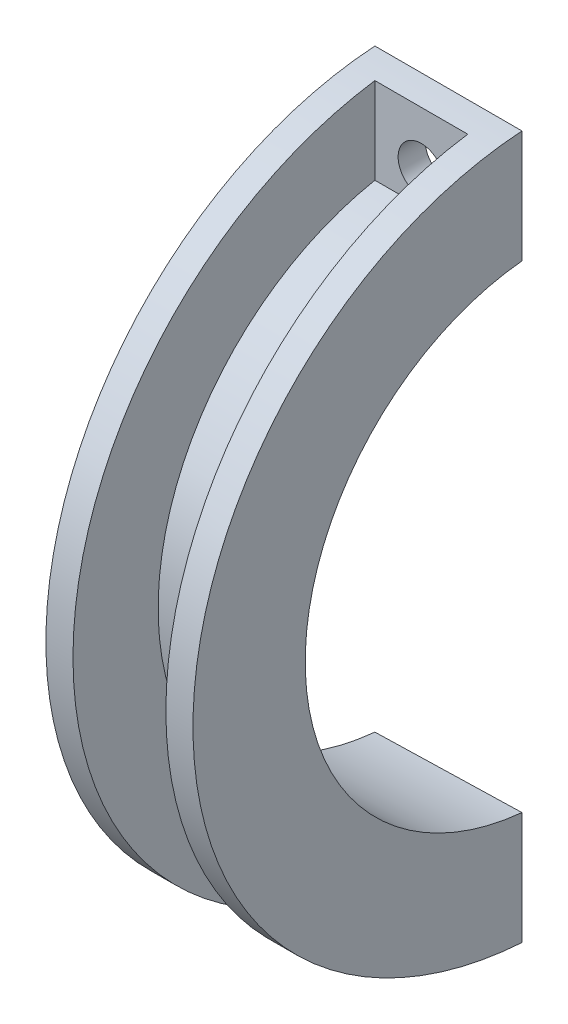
ISO-10303-21;
HEADER;
FILE_DESCRIPTION(('STEP AP214'),'2;1');
FILE_NAME('part.step','',(''),(''),'','','');
FILE_SCHEMA(('AUTOMOTIVE_DESIGN { 1 0 10303 214 1 1 1 1 }'));
ENDSEC;
DATA;
#1=APPLICATION_CONTEXT('core data for automotive mechanical design processes');
#2=APPLICATION_PROTOCOL_DEFINITION('international standard','automotive_design',2000,#1);
#3=PRODUCT_CONTEXT('',#1,'mechanical');
#4=PRODUCT('Part','Part','',(#3));
#5=PRODUCT_RELATED_PRODUCT_CATEGORY('part','',(#4));
#6=PRODUCT_DEFINITION_FORMATION('','',#4);
#7=PRODUCT_DEFINITION_CONTEXT('part definition',#1,'design');
#8=PRODUCT_DEFINITION('design','',#6,#7);
#9=PRODUCT_DEFINITION_SHAPE('','',#8);
#10=(LENGTH_UNIT() NAMED_UNIT(*) SI_UNIT(.MILLI.,.METRE.));
#11=(NAMED_UNIT(*) PLANE_ANGLE_UNIT() SI_UNIT($,.RADIAN.));
#12=(NAMED_UNIT(*) SI_UNIT($,.STERADIAN.) SOLID_ANGLE_UNIT());
#13=UNCERTAINTY_MEASURE_WITH_UNIT(LENGTH_MEASURE(1.E-05),#10,'distance_accuracy_value','');
#14=(GEOMETRIC_REPRESENTATION_CONTEXT(3) GLOBAL_UNCERTAINTY_ASSIGNED_CONTEXT((#13)) GLOBAL_UNIT_ASSIGNED_CONTEXT((#10,
#11,#12)) REPRESENTATION_CONTEXT('',''));
#15=CARTESIAN_POINT('',(0.,0.,0.));
#16=DIRECTION('',(0.,0.,1.));
#17=DIRECTION('',(1.,0.,0.));
#18=AXIS2_PLACEMENT_3D('',#15,#16,#17);
#19=CARTESIAN_POINT('',(589.521731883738,0.,2.99999999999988));
#20=DIRECTION('',(-1.,0.,0.));
#21=DIRECTION('',(0.,-1.,0.));
#22=AXIS2_PLACEMENT_3D('',#19,#20,#21);
#23=CYLINDRICAL_SURFACE('',#22,45.5);
#24=CARTESIAN_POINT('',(578.076766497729,0.,2.99999999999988));
#25=DIRECTION('',(-1.,0.,0.));
#26=DIRECTION('',(0.,-1.,0.));
#27=AXIS2_PLACEMENT_3D('',#24,#25,#26);
#28=CIRCLE('',#27,45.5);
#29=CARTESIAN_POINT('',(578.076766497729,-45.4009911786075,5.9999999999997));
#30=VERTEX_POINT('',#29);
#31=CARTESIAN_POINT('',(578.076766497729,45.4009911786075,5.99999999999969));
#32=VERTEX_POINT('',#31);
#33=EDGE_CURVE('E113',#30,#32,#28,.T.);
#34=ORIENTED_EDGE('',*,*,#33,.T.);
#35=DIRECTION('',(-1.,0.,0.));
#36=VECTOR('',#35,1.);
#37=CARTESIAN_POINT('',(589.521731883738,45.4009911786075,5.99999999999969));
#38=LINE('',#37,#36);
#39=CARTESIAN_POINT('',(559.076766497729,45.4009911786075,5.99999999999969));
#40=VERTEX_POINT('',#39);
#41=EDGE_CURVE('E46',#32,#40,#38,.T.);
#42=ORIENTED_EDGE('',*,*,#41,.T.);
#43=CARTESIAN_POINT('',(559.076766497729,0.,2.99999999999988));
#44=DIRECTION('',(-1.,0.,0.));
#45=DIRECTION('',(0.,-1.,0.));
#46=AXIS2_PLACEMENT_3D('',#43,#44,#45);
#47=CIRCLE('',#46,45.5);
#48=CARTESIAN_POINT('',(559.076766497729,-45.4009911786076,5.9999999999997));
#49=VERTEX_POINT('',#48);
#50=EDGE_CURVE('E116',#49,#40,#47,.T.);
#51=ORIENTED_EDGE('',*,*,#50,.F.);
#52=DIRECTION('',(-1.,0.,0.));
#53=VECTOR('',#52,1.);
#54=CARTESIAN_POINT('',(589.521731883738,-45.4009911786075,5.9999999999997));
#55=LINE('',#54,#53);
#56=EDGE_CURVE('E203',#49,#30,#55,.F.);
#57=ORIENTED_EDGE('',*,*,#56,.T.);
#58=EDGE_LOOP('',(#34,#42,#51,#57));
#59=FACE_BOUND('',#58,.T.);
#60=CARTESIAN_POINT('',(574.576766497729,0.,2.99999999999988));
#61=DIRECTION('',(-1.,0.,0.));
#62=DIRECTION('',(0.,-1.,0.));
#63=AXIS2_PLACEMENT_3D('',#60,#61,#62);
#64=CIRCLE('',#63,45.5);
#65=CARTESIAN_POINT('',(574.576766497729,-45.0333209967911,9.50000000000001));
#66=VERTEX_POINT('',#65);
#67=CARTESIAN_POINT('',(574.576766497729,45.0333209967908,9.50000000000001));
#68=VERTEX_POINT('',#67);
#69=EDGE_CURVE('E11',#66,#68,#64,.T.);
#70=ORIENTED_EDGE('',*,*,#69,.F.);
#71=DIRECTION('',(-1.,0.,0.));
#72=VECTOR('',#71,1.);
#73=CARTESIAN_POINT('',(574.576766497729,-45.0333209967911,9.50000000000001));
#74=LINE('',#73,#72);
#75=CARTESIAN_POINT('',(562.576766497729,-45.0333209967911,9.50000000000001));
#76=VERTEX_POINT('',#75);
#77=EDGE_CURVE('E114',#66,#76,#74,.T.);
#78=ORIENTED_EDGE('',*,*,#77,.T.);
#79=CARTESIAN_POINT('',(562.576766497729,0.,2.99999999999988));
#80=DIRECTION('',(-1.,0.,0.));
#81=DIRECTION('',(0.,-1.,0.));
#82=AXIS2_PLACEMENT_3D('',#79,#80,#81);
#83=CIRCLE('',#82,45.5);
#84=CARTESIAN_POINT('',(562.576766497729,45.0333209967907,9.50000000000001));
#85=VERTEX_POINT('',#84);
#86=EDGE_CURVE('E38',#76,#85,#83,.T.);
#87=ORIENTED_EDGE('',*,*,#86,.T.);
#88=DIRECTION('',(-1.,0.,0.));
#89=VECTOR('',#88,1.);
#90=CARTESIAN_POINT('',(574.576766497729,45.0333209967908,9.50000000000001));
#91=LINE('',#90,#89);
#92=EDGE_CURVE('E122',#68,#85,#91,.T.);
#93=ORIENTED_EDGE('',*,*,#92,.F.);
#94=EDGE_LOOP('',(#70,#78,#87,#93));
#95=FACE_BOUND('',#94,.T.);
#96=ADVANCED_FACE('F29',(#59,#95),#23,.T.);
#97=CARTESIAN_POINT('',(559.076766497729,0.,2.99999999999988));
#98=DIRECTION('',(-1.,0.,0.));
#99=DIRECTION('',(0.,-1.,0.));
#100=AXIS2_PLACEMENT_3D('',#97,#98,#99);
#101=CONICAL_SURFACE('',#100,31.4975325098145,0.0261799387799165);
#102=CARTESIAN_POINT('',(562.757658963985,-1.25660767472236,34.3759914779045));
#103=CARTESIAN_POINT('',(562.828250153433,-1.30261747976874,34.3722989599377));
#104=CARTESIAN_POINT('',(562.902778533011,-1.34269937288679,34.3686395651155));
#105=CARTESIAN_POINT('',(563.057581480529,-1.40981552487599,34.3616373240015));
#106=CARTESIAN_POINT('',(563.137862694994,-1.43683440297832,34.3582948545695));
#107=CARTESIAN_POINT('',(563.301817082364,-1.4769970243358,34.352130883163));
#108=CARTESIAN_POINT('',(563.385488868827,-1.49014638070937,34.3493091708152));
#109=CARTESIAN_POINT('',(563.553849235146,-1.50219727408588,34.3443203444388));
#110=CARTESIAN_POINT('',(563.638537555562,-1.50110237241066,34.3421530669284));
#111=CARTESIAN_POINT('',(563.806454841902,-1.4847059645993,34.3385320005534));
#112=CARTESIAN_POINT('',(563.889685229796,-1.46941918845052,34.3370774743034));
#113=CARTESIAN_POINT('',(564.052410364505,-1.42508751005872,34.3348591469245));
#114=CARTESIAN_POINT('',(564.131904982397,-1.39604213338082,34.3340953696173));
#115=CARTESIAN_POINT('',(564.284826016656,-1.32504787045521,34.3331696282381));
#116=CARTESIAN_POINT('',(564.358257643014,-1.28311021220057,34.333007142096));
#117=CARTESIAN_POINT('',(564.497045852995,-1.18751261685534,34.3331387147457));
#118=CARTESIAN_POINT('',(564.56240243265,-1.13385267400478,34.3334327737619));
#119=CARTESIAN_POINT('',(564.683213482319,-1.01630756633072,34.3343001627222));
#120=CARTESIAN_POINT('',(564.738663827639,-0.952418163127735,34.3348736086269));
#121=CARTESIAN_POINT('',(564.838057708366,-0.816241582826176,34.336112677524));
#122=CARTESIAN_POINT('',(564.882001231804,-0.74395439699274,34.3367783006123));
#123=CARTESIAN_POINT('',(564.95715615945,-0.592990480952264,34.3380300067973));
#124=CARTESIAN_POINT('',(564.988360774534,-0.5143103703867,34.3386160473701));
#125=CARTESIAN_POINT('',(565.03711809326,-0.352826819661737,34.3395731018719));
#126=CARTESIAN_POINT('',(565.054670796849,-0.270023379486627,34.3399441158));
#127=CARTESIAN_POINT('',(565.075624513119,-0.102650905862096,34.3403904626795));
#128=CARTESIAN_POINT('',(565.079026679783,-0.0180820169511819,34.3404658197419));
#129=CARTESIAN_POINT('',(565.071585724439,0.150426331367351,34.3403049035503));
#130=CARTESIAN_POINT('',(565.060742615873,0.234365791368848,34.3400686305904));
#131=CARTESIAN_POINT('',(565.025122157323,0.399219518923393,34.3393351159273));
#132=CARTESIAN_POINT('',(565.000346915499,0.480134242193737,34.3388379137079));
#133=CARTESIAN_POINT('',(564.937567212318,0.636656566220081,34.3376933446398));
#134=CARTESIAN_POINT('',(564.899562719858,0.71226415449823,34.3370459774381));
#135=CARTESIAN_POINT('',(564.811393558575,0.856042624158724,34.3357578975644));
#136=CARTESIAN_POINT('',(564.761226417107,0.924211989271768,34.3351171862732));
#137=CARTESIAN_POINT('',(564.650158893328,1.05116213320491,34.3340257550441));
#138=CARTESIAN_POINT('',(564.589258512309,1.10994291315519,34.3335750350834));
#139=CARTESIAN_POINT('',(564.458454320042,1.21644543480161,34.3330491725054));
#140=CARTESIAN_POINT('',(564.388550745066,1.26416746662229,34.3329740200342));
#141=CARTESIAN_POINT('',(564.241725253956,1.34719809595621,34.3333623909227));
#142=CARTESIAN_POINT('',(564.164803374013,1.38250675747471,34.3338259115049));
#143=CARTESIAN_POINT('',(564.006178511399,1.43969057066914,34.3354088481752));
#144=CARTESIAN_POINT('',(563.924478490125,1.46157394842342,34.3365278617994));
#145=CARTESIAN_POINT('',(563.758577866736,1.4913237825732,34.3394754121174));
#146=CARTESIAN_POINT('',(563.674377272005,1.49919028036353,34.3413039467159));
#147=CARTESIAN_POINT('',(563.505887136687,1.50069062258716,34.3456492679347));
#148=CARTESIAN_POINT('',(563.421597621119,1.49432775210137,34.3481658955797));
#149=CARTESIAN_POINT('',(563.255297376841,1.46756627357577,34.3537895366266));
#150=CARTESIAN_POINT('',(563.173286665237,1.44716756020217,34.356896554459));
#151=CARTESIAN_POINT('',(563.013771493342,1.39288990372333,34.3635355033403));
#152=CARTESIAN_POINT('',(562.93627211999,1.35899606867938,34.3670679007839));
#153=CARTESIAN_POINT('',(562.788064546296,1.27869190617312,34.3743280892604));
#154=CARTESIAN_POINT('',(562.717356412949,1.23228145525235,34.3780558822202));
#155=CARTESIAN_POINT('',(562.58462849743,1.12817818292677,34.3854490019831));
#156=CARTESIAN_POINT('',(562.522621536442,1.07046900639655,34.3891142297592));
#157=CARTESIAN_POINT('',(562.409176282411,0.945440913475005,34.3961005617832));
#158=CARTESIAN_POINT('',(562.35773800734,0.878121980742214,34.399421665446));
#159=CARTESIAN_POINT('',(562.266907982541,0.735795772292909,34.4054580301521));
#160=CARTESIAN_POINT('',(562.227513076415,0.660790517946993,34.4081734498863));
#161=CARTESIAN_POINT('',(562.161882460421,0.505204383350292,34.4127799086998));
#162=CARTESIAN_POINT('',(562.135646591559,0.424623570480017,34.4146709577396));
#163=CARTESIAN_POINT('',(562.09713402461,0.260362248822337,34.4174696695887));
#164=CARTESIAN_POINT('',(562.084826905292,0.176688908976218,34.4183794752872));
#165=CARTESIAN_POINT('',(562.07442503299,0.00846224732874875,34.4191474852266));
#166=CARTESIAN_POINT('',(562.076329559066,-0.0760910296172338,34.4190057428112));
#167=CARTESIAN_POINT('',(562.094276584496,-0.243514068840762,34.4176838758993));
#168=CARTESIAN_POINT('',(562.110292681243,-0.326386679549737,34.4165056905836));
#169=CARTESIAN_POINT('',(562.155973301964,-0.488284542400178,34.4132103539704));
#170=CARTESIAN_POINT('',(562.185641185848,-0.567308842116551,34.4110929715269));
#171=CARTESIAN_POINT('',(562.257813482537,-0.719343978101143,34.4060891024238));
#172=CARTESIAN_POINT('',(562.300333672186,-0.792347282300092,34.4032016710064));
#173=CARTESIAN_POINT('',(562.396960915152,-0.930119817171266,34.3968916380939));
#174=CARTESIAN_POINT('',(562.451054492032,-0.994898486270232,34.3934696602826));
#175=CARTESIAN_POINT('',(562.547652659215,-1.09260200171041,34.387656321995));
#176=CARTESIAN_POINT('',(562.587181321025,-1.12852374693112,34.385344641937));
#177=CARTESIAN_POINT('',(562.66983335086,-1.19595861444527,34.3806813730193));
#178=CARTESIAN_POINT('',(562.712956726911,-1.22747172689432,34.3783297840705));
#179=CARTESIAN_POINT('',(562.757658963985,-1.25660767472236,34.3759914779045));
#180=B_SPLINE_CURVE_WITH_KNOTS('',3,(#102,#103,#104,#105,#106,#107,#108,#109,#110,#111,#112,
#113,#114,#115,#116,#117,#118,#119,#120,#121,#122,#123,#124,#125,#126,#127,#128,#129,#130,#131,
#132,#133,#134,#135,#136,#137,#138,#139,#140,#141,#142,#143,#144,#145,#146,#147,#148,#149,#150,
#151,#152,#153,#154,#155,#156,#157,#158,#159,#160,#161,#162,#163,#164,#165,#166,#167,#168,#169,
#170,#171,#172,#173,#174,#175,#176,#177,#178,#179),.UNSPECIFIED.,.T.,.F.,(4,2,2,2,2,2,2,2,2,2,2,
2,2,2,2,2,2,2,2,2,2,2,2,2,2,2,2,2,2,2,2,2,2,2,2,2,2,2,4),(0.,0.252832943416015,
0.505962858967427,0.758990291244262,1.01195446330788,1.26465637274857,1.51736699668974,
1.76985815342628,2.02234943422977,2.27494560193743,2.52754203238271,2.78027290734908,
3.03300378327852,3.28571404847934,3.53842407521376,3.79109587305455,4.04376826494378,
4.29649206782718,4.54921584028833,4.80193298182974,5.05464882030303,5.30720965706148,
5.55976974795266,5.81227153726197,6.06477522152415,6.31755832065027,6.57034391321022,
6.82349815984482,7.07665283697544,7.32974110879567,7.58282632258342,7.83535770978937,
8.0878762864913,8.33992340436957,8.59203258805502,8.84445251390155,9.0965800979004,
9.25668751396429,9.41679528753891),.UNSPECIFIED.);
#181=CARTESIAN_POINT('',(562.757658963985,-1.25660767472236,34.3759914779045));
#182=VERTEX_POINT('',#181);
#183=EDGE_CURVE('E136',#182,#182,#180,.T.);
#184=ORIENTED_EDGE('',*,*,#183,.T.);
#185=EDGE_LOOP('',(#184));
#186=FACE_BOUND('',#185,.T.);
#187=CARTESIAN_POINT('',(578.076766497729,0.,2.99999999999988));
#188=DIRECTION('',(-1.,0.,0.));
#189=DIRECTION('',(0.,-1.,0.));
#190=AXIS2_PLACEMENT_3D('',#187,#188,#189);
#191=CIRCLE('',#190,31.);
#192=CARTESIAN_POINT('',(578.076766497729,-30.854497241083,5.99999999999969));
#193=VERTEX_POINT('',#192);
#194=CARTESIAN_POINT('',(578.076766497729,30.854497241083,5.99999999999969));
#195=VERTEX_POINT('',#194);
#196=EDGE_CURVE('E108',#193,#195,#191,.T.);
#197=ORIENTED_EDGE('',*,*,#196,.F.);
#198=CARTESIAN_POINT('',(629.646208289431,-29.49744351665,5.99999999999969));
#199=CARTESIAN_POINT('',(609.355501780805,-30.0315014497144,5.99999999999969));
#200=CARTESIAN_POINT('',(589.064791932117,-30.5654324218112,5.99999999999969));
#201=CARTESIAN_POINT('',(548.483365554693,-31.6330404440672,5.99999999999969));
#202=CARTESIAN_POINT('',(528.192649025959,-32.1667174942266,5.9999999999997));
#203=CARTESIAN_POINT('',(507.901929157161,-32.7002675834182,5.9999999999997));
#204=B_SPLINE_CURVE_WITH_KNOTS('',3,(#198,#199,#200,#201,#202,#203),.UNSPECIFIED.,.F.,.F.,(4,2,
4),(0.,60.8932007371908,121.786401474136),.UNSPECIFIED.);
#205=CARTESIAN_POINT('',(559.076766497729,-31.3543386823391,5.99999999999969));
#206=VERTEX_POINT('',#205);
#207=EDGE_CURVE('E54',#193,#206,#204,.T.);
#208=ORIENTED_EDGE('',*,*,#207,.T.);
#209=CARTESIAN_POINT('',(559.076766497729,0.,2.99999999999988));
#210=DIRECTION('',(-1.,0.,0.));
#211=DIRECTION('',(0.,-1.,0.));
#212=AXIS2_PLACEMENT_3D('',#209,#210,#211);
#213=CIRCLE('',#212,31.4975325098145);
#214=CARTESIAN_POINT('',(559.076766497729,31.3543386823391,5.99999999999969));
#215=VERTEX_POINT('',#214);
#216=EDGE_CURVE('E110',#206,#215,#213,.T.);
#217=ORIENTED_EDGE('',*,*,#216,.T.);
#218=CARTESIAN_POINT('',(507.90192915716,32.7002675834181,5.99999999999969));
#219=CARTESIAN_POINT('',(528.192649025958,32.1667174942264,5.99999999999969));
#220=CARTESIAN_POINT('',(548.483365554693,31.6330404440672,5.99999999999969));
#221=CARTESIAN_POINT('',(589.064791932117,30.5654324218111,5.99999999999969));
#222=CARTESIAN_POINT('',(609.355501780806,30.0315014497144,5.99999999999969));
#223=CARTESIAN_POINT('',(629.646208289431,29.49744351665,5.99999999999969));
#224=B_SPLINE_CURVE_WITH_KNOTS('',3,(#218,#219,#220,#221,#222,#223),.UNSPECIFIED.,.F.,.F.,(4,2,
4),(0.,60.8932007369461,121.786401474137),.UNSPECIFIED.);
#225=EDGE_CURVE('E95',#215,#195,#224,.T.);
#226=ORIENTED_EDGE('',*,*,#225,.T.);
#227=EDGE_LOOP('',(#197,#208,#217,#226));
#228=FACE_BOUND('',#227,.T.);
#229=ADVANCED_FACE('F107',(#186,#228),#101,.F.);
#230=CARTESIAN_POINT('',(559.076766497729,-45.5,2.99999999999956));
#231=DIRECTION('',(1.,0.,0.));
#232=DIRECTION('',(0.,1.,0.));
#233=AXIS2_PLACEMENT_3D('',#230,#231,#232);
#234=PLANE('',#233);
#235=ORIENTED_EDGE('',*,*,#50,.T.);
#236=DIRECTION('',(0.,-1.,0.));
#237=VECTOR('',#236,1.);
#238=CARTESIAN_POINT('',(559.076766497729,-45.5,5.9999999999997));
#239=LINE('',#238,#237);
#240=EDGE_CURVE('E200',#40,#215,#239,.T.);
#241=ORIENTED_EDGE('',*,*,#240,.T.);
#242=ORIENTED_EDGE('',*,*,#216,.F.);
#243=EDGE_CURVE('E201',#206,#49,#239,.T.);
#244=ORIENTED_EDGE('',*,*,#243,.T.);
#245=EDGE_LOOP('',(#235,#241,#242,#244));
#246=FACE_BOUND('',#245,.T.);
#247=ADVANCED_FACE('F31',(#246),#234,.F.);
#248=CARTESIAN_POINT('',(578.076766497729,-31.,2.99999999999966));
#249=DIRECTION('',(-1.,0.,0.));
#250=DIRECTION('',(0.,-1.,0.));
#251=AXIS2_PLACEMENT_3D('',#248,#249,#250);
#252=PLANE('',#251);
#253=ORIENTED_EDGE('',*,*,#33,.F.);
#254=DIRECTION('',(0.,1.,0.));
#255=VECTOR('',#254,1.);
#256=CARTESIAN_POINT('',(578.076766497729,-31.,5.99999999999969));
#257=LINE('',#256,#255);
#258=EDGE_CURVE('E103',#30,#193,#257,.T.);
#259=ORIENTED_EDGE('',*,*,#258,.T.);
#260=ORIENTED_EDGE('',*,*,#196,.T.);
#261=EDGE_CURVE('E92',#195,#32,#257,.T.);
#262=ORIENTED_EDGE('',*,*,#261,.T.);
#263=EDGE_LOOP('',(#253,#259,#260,#262));
#264=FACE_BOUND('',#263,.T.);
#265=ADVANCED_FACE('F112',(#264),#252,.F.);
#266=CARTESIAN_POINT('',(574.576766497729,0.,2.99999999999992));
#267=DIRECTION('',(-1.,0.,0.));
#268=DIRECTION('',(0.,-1.,0.));
#269=AXIS2_PLACEMENT_3D('',#266,#267,#268);
#270=PLANE('',#269);
#271=ORIENTED_EDGE('',*,*,#69,.T.);
#272=DIRECTION('',(0.,1.,0.));
#273=VECTOR('',#272,1.);
#274=CARTESIAN_POINT('',(574.576766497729,33.8821486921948,9.50000000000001));
#275=LINE('',#274,#273);
#276=CARTESIAN_POINT('',(574.576766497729,33.882148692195,9.50000000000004));
#277=VERTEX_POINT('',#276);
#278=EDGE_CURVE('E237',#277,#68,#275,.T.);
#279=ORIENTED_EDGE('',*,*,#278,.F.);
#280=CARTESIAN_POINT('',(574.576766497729,0.,2.99999999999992));
#281=DIRECTION('',(-1.,0.,0.));
#282=DIRECTION('',(0.,-1.,0.));
#283=AXIS2_PLACEMENT_3D('',#280,#281,#282);
#284=CIRCLE('',#283,34.5000000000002);
#285=CARTESIAN_POINT('',(574.576766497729,-33.8821486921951,9.50000000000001));
#286=VERTEX_POINT('',#285);
#287=EDGE_CURVE('E240',#286,#277,#284,.T.);
#288=ORIENTED_EDGE('',*,*,#287,.F.);
#289=DIRECTION('',(0.,1.,0.));
#290=VECTOR('',#289,1.);
#291=CARTESIAN_POINT('',(574.576766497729,-33.8821486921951,9.50000000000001));
#292=LINE('',#291,#290);
#293=EDGE_CURVE('E242',#66,#286,#292,.T.);
#294=ORIENTED_EDGE('',*,*,#293,.F.);
#295=EDGE_LOOP('',(#271,#279,#288,#294));
#296=FACE_BOUND('',#295,.T.);
#297=ADVANCED_FACE('F167',(#296),#270,.T.);
#298=CARTESIAN_POINT('',(562.576766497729,0.,2.99999999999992));
#299=DIRECTION('',(-1.,0.,0.));
#300=DIRECTION('',(0.,-1.,0.));
#301=AXIS2_PLACEMENT_3D('',#298,#299,#300);
#302=PLANE('',#301);
#303=DIRECTION('',(0.,1.,0.));
#304=VECTOR('',#303,1.);
#305=CARTESIAN_POINT('',(562.576766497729,-33.8821486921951,9.50000000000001));
#306=LINE('',#305,#304);
#307=CARTESIAN_POINT('',(562.576766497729,-33.8821486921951,9.50000000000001));
#308=VERTEX_POINT('',#307);
#309=EDGE_CURVE('E235',#76,#308,#306,.T.);
#310=ORIENTED_EDGE('',*,*,#309,.T.);
#311=CARTESIAN_POINT('',(562.576766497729,0.,2.99999999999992));
#312=DIRECTION('',(-1.,0.,0.));
#313=DIRECTION('',(0.,-1.,0.));
#314=AXIS2_PLACEMENT_3D('',#311,#312,#313);
#315=CIRCLE('',#314,34.5000000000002);
#316=CARTESIAN_POINT('',(562.576766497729,33.882148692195,9.50000000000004));
#317=VERTEX_POINT('',#316);
#318=EDGE_CURVE('E233',#308,#317,#315,.T.);
#319=ORIENTED_EDGE('',*,*,#318,.T.);
#320=DIRECTION('',(0.,1.,0.));
#321=VECTOR('',#320,1.);
#322=CARTESIAN_POINT('',(562.576766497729,33.8821486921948,9.50000000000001));
#323=LINE('',#322,#321);
#324=EDGE_CURVE('E133',#317,#85,#323,.T.);
#325=ORIENTED_EDGE('',*,*,#324,.T.);
#326=ORIENTED_EDGE('',*,*,#86,.F.);
#327=EDGE_LOOP('',(#310,#319,#325,#326));
#328=FACE_BOUND('',#327,.T.);
#329=ADVANCED_FACE('F163',(#328),#302,.F.);
#330=CARTESIAN_POINT('',(574.576766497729,-33.8821486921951,9.50000000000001));
#331=DIRECTION('',(0.,0.,1.));
#332=DIRECTION('',(0.,-1.,0.));
#333=AXIS2_PLACEMENT_3D('',#330,#331,#332);
#334=PLANE('',#333);
#335=CARTESIAN_POINT('',(568.576766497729,-38.,9.50000000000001));
#336=DIRECTION('',(0.,0.,1.));
#337=DIRECTION('',(0.,-1.,0.));
#338=AXIS2_PLACEMENT_3D('',#335,#336,#337);
#339=CIRCLE('',#338,3.00000000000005);
#340=CARTESIAN_POINT('',(568.576766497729,-41.0000000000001,9.50000000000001));
#341=VERTEX_POINT('',#340);
#342=EDGE_CURVE('E134',#341,#341,#339,.T.);
#343=ORIENTED_EDGE('',*,*,#342,.F.);
#344=EDGE_LOOP('',(#343));
#345=FACE_BOUND('',#344,.T.);
#346=ORIENTED_EDGE('',*,*,#309,.F.);
#347=ORIENTED_EDGE('',*,*,#77,.F.);
#348=ORIENTED_EDGE('',*,*,#293,.T.);
#349=DIRECTION('',(-1.,0.,0.));
#350=VECTOR('',#349,1.);
#351=CARTESIAN_POINT('',(574.576766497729,-33.8821486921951,9.50000000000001));
#352=LINE('',#351,#350);
#353=EDGE_CURVE('E119',#286,#308,#352,.T.);
#354=ORIENTED_EDGE('',*,*,#353,.T.);
#355=EDGE_LOOP('',(#346,#347,#348,#354));
#356=FACE_BOUND('',#355,.T.);
#357=ADVANCED_FACE('F166',(#345,#356),#334,.T.);
#358=CARTESIAN_POINT('',(574.576766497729,0.,2.99999999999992));
#359=DIRECTION('',(-1.,0.,0.));
#360=DIRECTION('',(0.,-1.,0.));
#361=AXIS2_PLACEMENT_3D('',#358,#359,#360);
#362=CYLINDRICAL_SURFACE('',#361,34.5000000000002);
#363=ORIENTED_EDGE('',*,*,#318,.F.);
#364=ORIENTED_EDGE('',*,*,#353,.F.);
#365=ORIENTED_EDGE('',*,*,#287,.T.);
#366=DIRECTION('',(-1.,0.,0.));
#367=VECTOR('',#366,1.);
#368=CARTESIAN_POINT('',(574.576766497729,33.882148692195,9.50000000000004));
#369=LINE('',#368,#367);
#370=EDGE_CURVE('E245',#277,#317,#369,.T.);
#371=ORIENTED_EDGE('',*,*,#370,.T.);
#372=EDGE_LOOP('',(#363,#364,#365,#371));
#373=FACE_BOUND('',#372,.T.);
#374=ADVANCED_FACE('F174',(#373),#362,.T.);
#375=CARTESIAN_POINT('',(574.576766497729,33.8821486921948,9.50000000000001));
#376=DIRECTION('',(0.,0.,1.));
#377=DIRECTION('',(0.,-1.,0.));
#378=AXIS2_PLACEMENT_3D('',#375,#376,#377);
#379=PLANE('',#378);
#380=CARTESIAN_POINT('',(568.576766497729,38.,9.50000000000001));
#381=DIRECTION('',(0.,0.,1.));
#382=DIRECTION('',(0.,-1.,0.));
#383=AXIS2_PLACEMENT_3D('',#380,#381,#382);
#384=CIRCLE('',#383,3.00000000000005);
#385=CARTESIAN_POINT('',(568.576766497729,34.9999999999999,9.50000000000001));
#386=VERTEX_POINT('',#385);
#387=EDGE_CURVE('E130',#386,#386,#384,.T.);
#388=ORIENTED_EDGE('',*,*,#387,.F.);
#389=EDGE_LOOP('',(#388));
#390=FACE_BOUND('',#389,.T.);
#391=ORIENTED_EDGE('',*,*,#324,.F.);
#392=ORIENTED_EDGE('',*,*,#370,.F.);
#393=ORIENTED_EDGE('',*,*,#278,.T.);
#394=ORIENTED_EDGE('',*,*,#92,.T.);
#395=EDGE_LOOP('',(#391,#392,#393,#394));
#396=FACE_BOUND('',#395,.T.);
#397=ADVANCED_FACE('F161',(#390,#396),#379,.T.);
#398=CARTESIAN_POINT('',(568.576766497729,37.9999999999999,48.5000000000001));
#399=DIRECTION('',(0.,0.,-1.));
#400=DIRECTION('',(0.,1.,0.));
#401=AXIS2_PLACEMENT_3D('',#398,#399,#400);
#402=CYLINDRICAL_SURFACE('',#401,3.00000000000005);
#403=CARTESIAN_POINT('',(568.576766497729,38.,5.99999999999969));
#404=DIRECTION('',(0.,0.,1.));
#405=DIRECTION('',(0.,-1.,0.));
#406=AXIS2_PLACEMENT_3D('',#403,#404,#405);
#407=CIRCLE('',#406,3.00000000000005);
#408=CARTESIAN_POINT('',(568.576766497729,34.9999999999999,5.99999999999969));
#409=VERTEX_POINT('',#408);
#410=EDGE_CURVE('E101',#409,#409,#407,.F.);
#411=ORIENTED_EDGE('',*,*,#410,.T.);
#412=EDGE_LOOP('',(#411));
#413=FACE_BOUND('',#412,.T.);
#414=ORIENTED_EDGE('',*,*,#387,.T.);
#415=EDGE_LOOP('',(#414));
#416=FACE_BOUND('',#415,.T.);
#417=ADVANCED_FACE('F157',(#413,#416),#402,.F.);
#418=CARTESIAN_POINT('',(568.576766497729,-38.0000000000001,48.4999999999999));
#419=DIRECTION('',(0.,0.,-1.));
#420=DIRECTION('',(0.,1.,0.));
#421=AXIS2_PLACEMENT_3D('',#418,#419,#420);
#422=CYLINDRICAL_SURFACE('',#421,3.00000000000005);
#423=CARTESIAN_POINT('',(568.576766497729,-38.,5.9999999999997));
#424=DIRECTION('',(0.,0.,1.));
#425=DIRECTION('',(0.,-1.,0.));
#426=AXIS2_PLACEMENT_3D('',#423,#424,#425);
#427=CIRCLE('',#426,3.00000000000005);
#428=CARTESIAN_POINT('',(568.576766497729,-41.,5.9999999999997));
#429=VERTEX_POINT('',#428);
#430=EDGE_CURVE('E33',#429,#429,#427,.F.);
#431=ORIENTED_EDGE('',*,*,#430,.T.);
#432=EDGE_LOOP('',(#431));
#433=FACE_BOUND('',#432,.T.);
#434=ORIENTED_EDGE('',*,*,#342,.T.);
#435=EDGE_LOOP('',(#434));
#436=FACE_BOUND('',#435,.T.);
#437=ADVANCED_FACE('F152',(#433,#436),#422,.F.);
#438=CARTESIAN_POINT('',(563.576766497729,0.,35.9999999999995));
#439=DIRECTION('',(0.,0.,-1.));
#440=DIRECTION('',(0.,1.,0.));
#441=AXIS2_PLACEMENT_3D('',#438,#439,#440);
#442=CYLINDRICAL_SURFACE('',#441,1.49999999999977);
#443=CARTESIAN_POINT('',(563.576766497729,0.,35.9999999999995));
#444=DIRECTION('',(0.,0.,-1.));
#445=DIRECTION('',(0.,1.,0.));
#446=AXIS2_PLACEMENT_3D('',#443,#444,#445);
#447=CIRCLE('',#446,1.49999999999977);
#448=CARTESIAN_POINT('',(563.576766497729,1.49999999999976,35.9999999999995));
#449=VERTEX_POINT('',#448);
#450=EDGE_CURVE('E142',#449,#449,#447,.T.);
#451=ORIENTED_EDGE('',*,*,#450,.F.);
#452=EDGE_LOOP('',(#451));
#453=FACE_BOUND('',#452,.T.);
#454=ORIENTED_EDGE('',*,*,#183,.F.);
#455=EDGE_LOOP('',(#454));
#456=FACE_BOUND('',#455,.T.);
#457=ADVANCED_FACE('F146',(#453,#456),#442,.F.);
#458=CARTESIAN_POINT('',(563.576766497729,0.,35.9999999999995));
#459=DIRECTION('',(0.,0.,-1.));
#460=DIRECTION('',(0.,1.,0.));
#461=AXIS2_PLACEMENT_3D('',#458,#459,#460);
#462=PLANE('',#461);
#463=ORIENTED_EDGE('',*,*,#450,.T.);
#464=EDGE_LOOP('',(#463));
#465=FACE_BOUND('',#464,.T.);
#466=ADVANCED_FACE('F151',(#465),#462,.T.);
#467=CARTESIAN_POINT('',(429.701766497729,50.0000000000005,5.99999999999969));
#468=DIRECTION('',(0.,0.,1.));
#469=DIRECTION('',(0.,-1.,0.));
#470=AXIS2_PLACEMENT_3D('',#467,#468,#469);
#471=PLANE('',#470);
#472=ORIENTED_EDGE('',*,*,#430,.F.);
#473=EDGE_LOOP('',(#472));
#474=FACE_BOUND('',#473,.T.);
#475=ORIENTED_EDGE('',*,*,#243,.F.);
#476=ORIENTED_EDGE('',*,*,#207,.F.);
#477=ORIENTED_EDGE('',*,*,#258,.F.);
#478=ORIENTED_EDGE('',*,*,#56,.F.);
#479=EDGE_LOOP('',(#475,#476,#477,#478));
#480=FACE_BOUND('',#479,.T.);
#481=ADVANCED_FACE('F215',(#474,#480),#471,.F.);
#482=ORIENTED_EDGE('',*,*,#410,.F.);
#483=EDGE_LOOP('',(#482));
#484=FACE_BOUND('',#483,.T.);
#485=ORIENTED_EDGE('',*,*,#240,.F.);
#486=ORIENTED_EDGE('',*,*,#41,.F.);
#487=ORIENTED_EDGE('',*,*,#261,.F.);
#488=ORIENTED_EDGE('',*,*,#225,.F.);
#489=EDGE_LOOP('',(#485,#486,#487,#488));
#490=FACE_BOUND('',#489,.T.);
#491=ADVANCED_FACE('F94',(#484,#490),#471,.F.);
#492=CLOSED_SHELL('',(#96,#229,#247,#265,#297,#329,#357,#374,#397,#417,#437,#457,#466,#481,#491));
#493=MANIFOLD_SOLID_BREP('B2',#492);
#494=ADVANCED_BREP_SHAPE_REPRESENTATION('',(#18,#493),#14);
#495=SHAPE_DEFINITION_REPRESENTATION(#9,#494);
ENDSEC;
END-ISO-10303-21;
